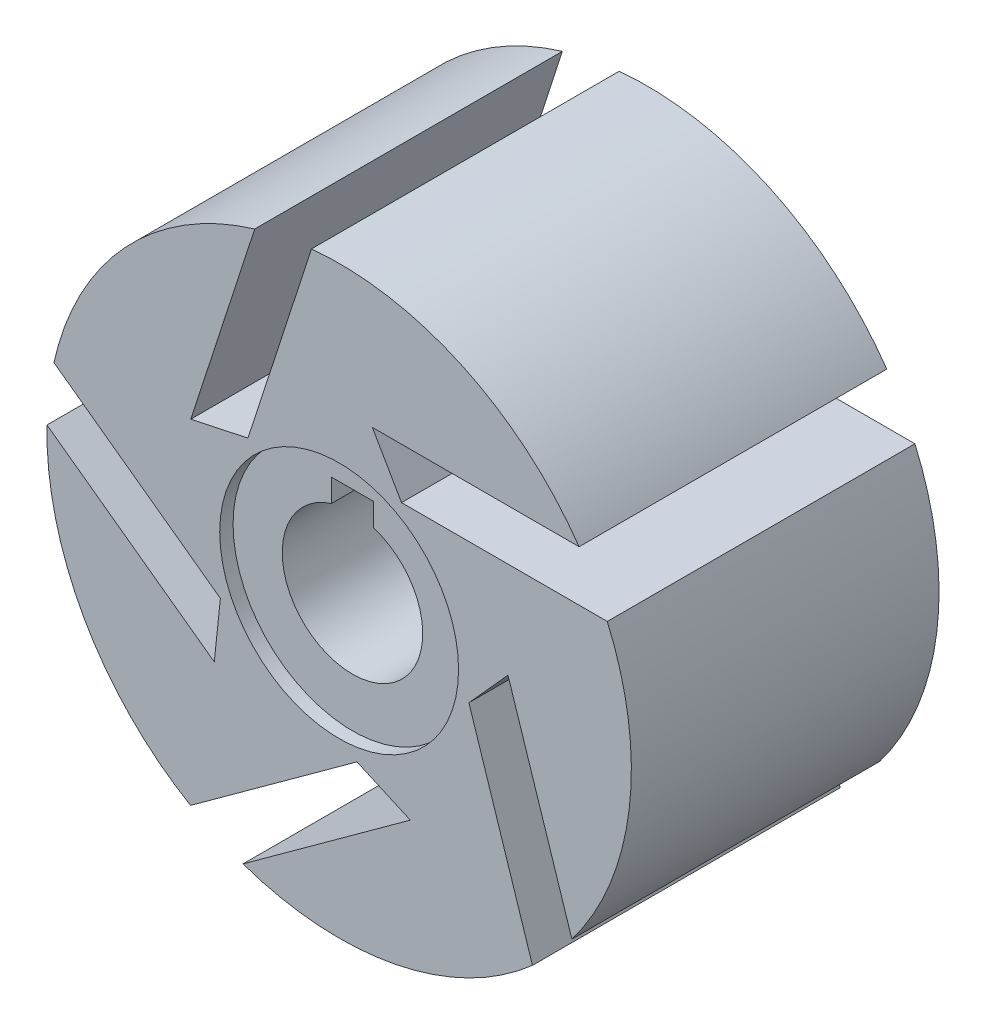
from build123d import *

# Parameters (mm, degrees)
ESQUISSE1_R                  = 20.799999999
BOSS_EXTRU_1_DEPTH           = 21.9
ENL_V_MAT_EXTRU_1_DEPTH      = 37.67274192
R_P_TITION_CIRCULAIRE1_COUNT = 5
ESQUISSE3_R                  = 5
ENL_V_MAT_EXTRU_2_DEPTH      = 37.67274192
ESQUISSE4_W                  = 3
ESQUISSE4_H                  = 3
ENL_V_MAT_EXTRU_3_DEPTH      = 37.67274192
ESQUISSE5_R                  = 8.5
ENL_V_MAT_EXTRU_4_DEPTH      = 0.95
ENL_V_START                  = -0.95
ESQUISSE6_R                  = 8.5
ENL_V_MAT_EXTRU_5_DEPTH      = 0.95


with BuildPart() as part:
    # Esquisse1 → Boss.-Extru.1 (new body)
    with BuildSketch(Plane(origin=(21.9, 0, 0), x_dir=(-1, 0, 0), z_dir=(0, 0, -1))):
        with Locations((21.9, 0)):
            Circle(ESQUISSE1_R)
    extrude(amount=-BOSS_EXTRU_1_DEPTH)

    # Esquisse2 → Enl_v. mat.-Extru.1 (cut, through all)
    with BuildSketch(Plane(origin=(0, 0, 0), x_dir=(-1, 0, 0), z_dir=(0, 0, -1))):
        with BuildLine():
            Line((-17.081309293, 11.868819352), (-2.362309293, 11.868819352))
            Line((-2.362309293, 11.868819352), (-4.440770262, 8.268819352))
            Line((-4.440770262, 8.268819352), (-19.085770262, 8.268819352))
            ThreePointArc((-19.085770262, 8.268819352), (-18.172903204, 10.118576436), (-17.081309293, 11.868819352))
        make_face()
    enl_v_mat_extru_1 = extrude(amount=-ENL_V_MAT_EXTRU_1_DEPTH, mode=Mode.SUBTRACT)

    # R_p_tition circulaire1: Enl_v. mat.-Extru.1 ×5 about axis
    r_p_tition_circulaire1_axis = Axis((0, 0, 0), (0, 0, 1))
    for i in range(1, R_P_TITION_CIRCULAIRE1_COUNT):
        add(enl_v_mat_extru_1.rotate(r_p_tition_circulaire1_axis, i * 360 / R_P_TITION_CIRCULAIRE1_COUNT), mode=Mode.SUBTRACT)

    # Esquisse3 → Enl_v. mat.-Extru.2 (cut, through all)
    with BuildSketch(Plane(origin=(0, 0, 0), x_dir=(-1, 0, 0), z_dir=(0, 0, -1))):
        Circle(ESQUISSE3_R)
    extrude(amount=-ENL_V_MAT_EXTRU_2_DEPTH, mode=Mode.SUBTRACT)

    # Esquisse4 → Enl_v. mat.-Extru.3 (cut, through all)
    with BuildSketch(Plane(origin=(0, 0, 0), x_dir=(-1, 0, 0), z_dir=(0, 0, -1))):
        with Locations((0, 4.9)):
            Rectangle(ESQUISSE4_W, ESQUISSE4_H)
    extrude(amount=-ENL_V_MAT_EXTRU_3_DEPTH, mode=Mode.SUBTRACT)

    # Esquisse5 → Enl_v. mat.-Extru.4 (cut)
    with BuildSketch(Plane(origin=(0, 0, 0), x_dir=(-1, 0, 0), z_dir=(0, 0, -1))):
        Circle(ESQUISSE5_R)
    extrude(amount=-ENL_V_MAT_EXTRU_4_DEPTH, mode=Mode.SUBTRACT)

    # Esquisse6 → Enl_v. mat.-Extru.5 (cut)
    with BuildSketch(Plane.XY.offset(21.9).offset(ENL_V_START)):
        with Locations(Location((0, 0, 0), (0, 0, 180))):
            Circle(ESQUISSE6_R)
    extrude(amount=ENL_V_MAT_EXTRU_5_DEPTH, mode=Mode.SUBTRACT)


solid = part.part
